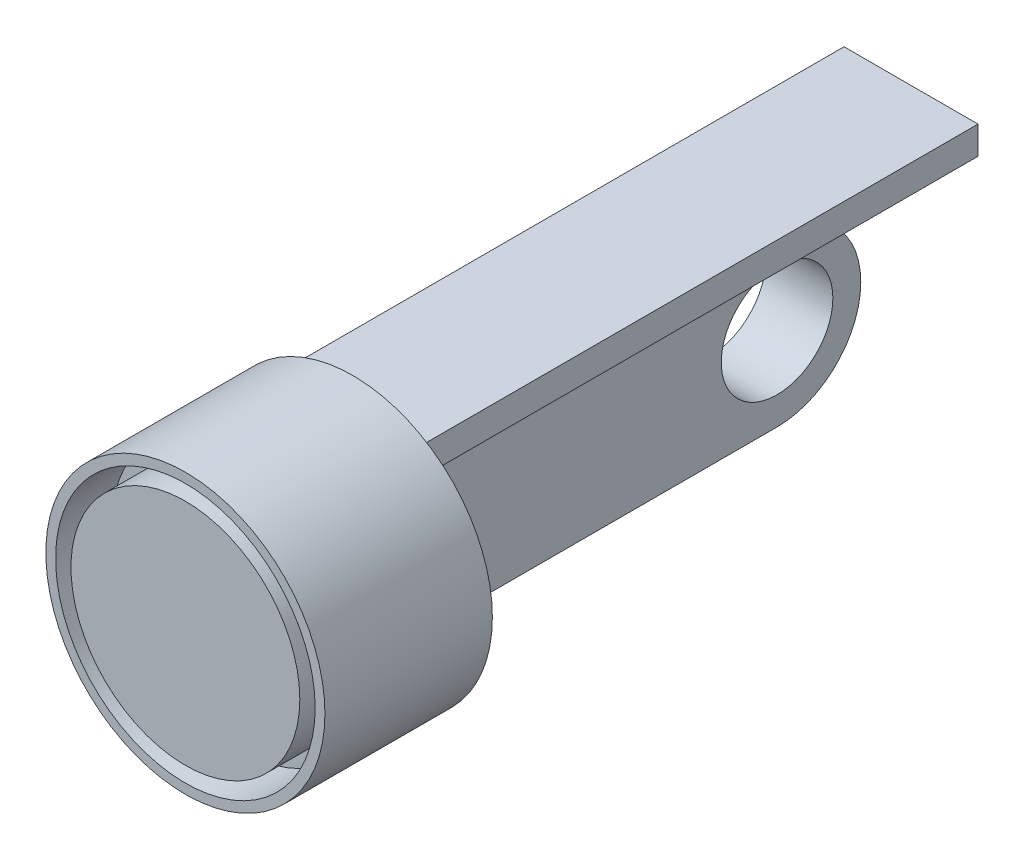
from build123d import *

# Parameters (mm, degrees)
SKETCH2_R                = 25
BOSS_EXTRUDE1_DEPTH      = 30
BOSS_EXTRUDE2_DEPTH      = 6
BOSS_EXTRUDE2_DEPTH_BACK = 6
SKETCH3_R                = 10
SKETCH4_W                = 24
SKETCH4_H                = 100
BOSS_EXTRUDE3_DEPTH      = 5
SKETCH5_R                = 23.25
SKETCH5_R_2              = 20.5
CUT_EXTRUDE1_DEPTH       = 10


with BuildPart() as part:
    # Sketch2 → Boss-Extrude1 (new body)
    with BuildSketch(Plane.XY):
        Circle(SKETCH2_R)
    extrude(amount=BOSS_EXTRUDE1_DEPTH)

    # Sketch3 → Boss-Extrude2 (add, two sides: drawn at the far end of the back side and taken through both)
    with BuildSketch(Plane(origin=(0, 0, 0), x_dir=(0, 0, -1), z_dir=(1, 0, 0)).offset(-BOSS_EXTRUDE2_DEPTH_BACK)):
        with BuildLine():
            Line((0, 15), (70, 15))
            ThreePointArc((70, 15), (85, 0), (70, -15))
            Line((70, -15), (0, -15))
            Line((0, -15), (0, 15))
        make_face()
        with Locations((70, 0)):
            Circle(SKETCH3_R, mode=Mode.SUBTRACT)
    extrude(amount=BOSS_EXTRUDE2_DEPTH + BOSS_EXTRUDE2_DEPTH_BACK)

    # Sketch4 → Boss-Extrude3 (add)
    with BuildSketch(Plane(origin=(0, 15, 0), x_dir=(1, 0, 0), z_dir=(0, 1, 0))):
        with Locations((0, 50)):
            Rectangle(SKETCH4_W, SKETCH4_H)
    extrude(amount=BOSS_EXTRUDE3_DEPTH)

    # Sketch5 → Cut-Extrude1 (cut)
    with BuildSketch(Plane.XY.offset(30)):
        Circle(SKETCH5_R)
        Circle(SKETCH5_R_2, mode=Mode.SUBTRACT)
    extrude(amount=-CUT_EXTRUDE1_DEPTH, mode=Mode.SUBTRACT)


solid = part.part
